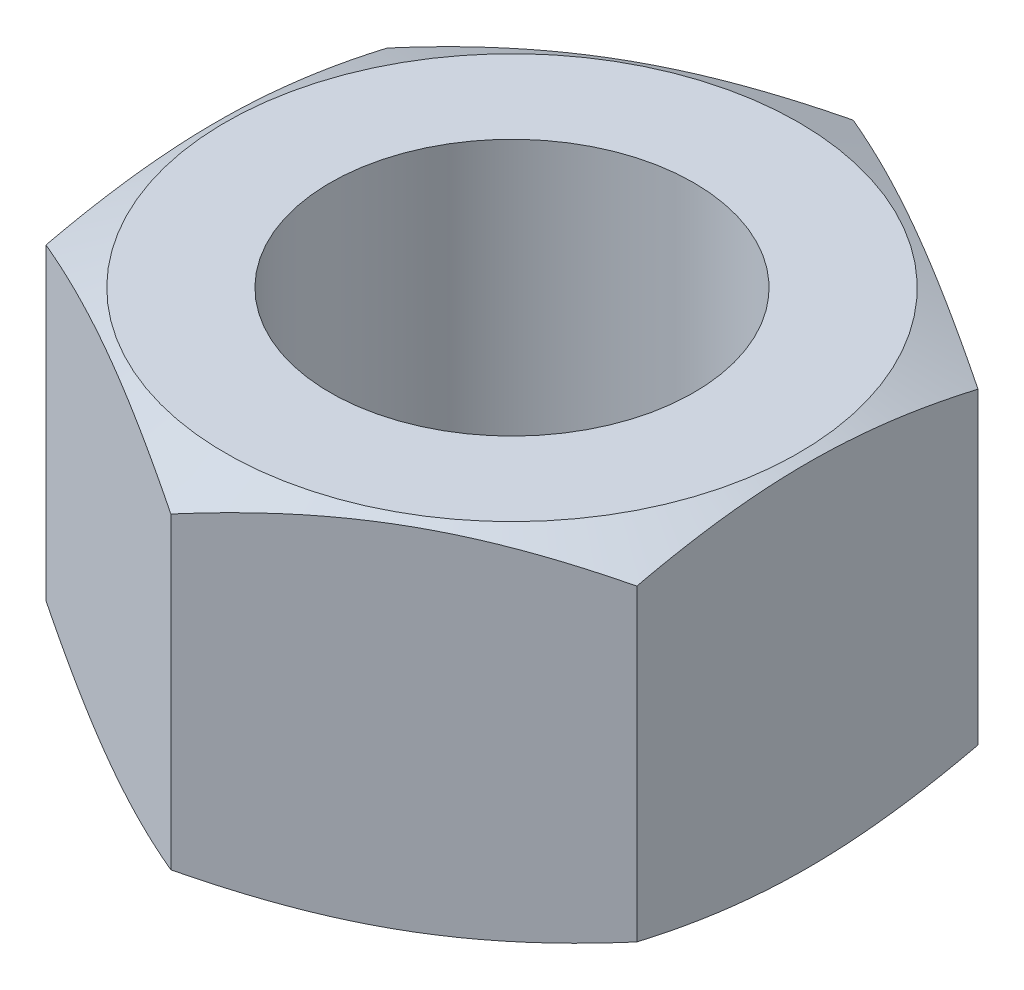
ISO-10303-21;
HEADER;
FILE_DESCRIPTION(('STEP AP214'),'2;1');
FILE_NAME('part.step','',(''),(''),'','','');
FILE_SCHEMA(('AUTOMOTIVE_DESIGN { 1 0 10303 214 1 1 1 1 }'));
ENDSEC;
DATA;
#1=APPLICATION_CONTEXT('core data for automotive mechanical design processes');
#2=APPLICATION_PROTOCOL_DEFINITION('international standard','automotive_design',2000,#1);
#3=PRODUCT_CONTEXT('',#1,'mechanical');
#4=PRODUCT('Part','Part','',(#3));
#5=PRODUCT_RELATED_PRODUCT_CATEGORY('part','',(#4));
#6=PRODUCT_DEFINITION_FORMATION('','',#4);
#7=PRODUCT_DEFINITION_CONTEXT('part definition',#1,'design');
#8=PRODUCT_DEFINITION('design','',#6,#7);
#9=PRODUCT_DEFINITION_SHAPE('','',#8);
#10=(LENGTH_UNIT() NAMED_UNIT(*) SI_UNIT(.MILLI.,.METRE.));
#11=(NAMED_UNIT(*) PLANE_ANGLE_UNIT() SI_UNIT($,.RADIAN.));
#12=(NAMED_UNIT(*) SI_UNIT($,.STERADIAN.) SOLID_ANGLE_UNIT());
#13=UNCERTAINTY_MEASURE_WITH_UNIT(LENGTH_MEASURE(1.E-05),#10,'distance_accuracy_value','');
#14=(GEOMETRIC_REPRESENTATION_CONTEXT(3) GLOBAL_UNCERTAINTY_ASSIGNED_CONTEXT((#13)) GLOBAL_UNIT_ASSIGNED_CONTEXT((#10,
#11,#12)) REPRESENTATION_CONTEXT('',''));
#15=CARTESIAN_POINT('',(0.,0.,0.));
#16=DIRECTION('',(0.,0.,1.));
#17=DIRECTION('',(1.,0.,0.));
#18=AXIS2_PLACEMENT_3D('',#15,#16,#17);
#19=CARTESIAN_POINT('',(6.30466493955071,0.,0.));
#20=DIRECTION('',(0.,-1.,0.));
#21=DIRECTION('',(0.,0.,-1.));
#22=AXIS2_PLACEMENT_3D('',#19,#20,#21);
#23=PLANE('',#22);
#24=CARTESIAN_POINT('',(0.,0.,0.));
#25=DIRECTION('',(0.,-1.,0.));
#26=DIRECTION('',(0.,0.,-1.));
#27=AXIS2_PLACEMENT_3D('',#24,#25,#26);
#28=CIRCLE('',#27,6.30466493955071);
#29=CARTESIAN_POINT('',(0.,0.,-6.30466493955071));
#30=VERTEX_POINT('',#29);
#31=EDGE_CURVE('E187',#30,#30,#28,.T.);
#32=ORIENTED_EDGE('',*,*,#31,.T.);
#33=EDGE_LOOP('',(#32));
#34=FACE_BOUND('',#33,.T.);
#35=CARTESIAN_POINT('',(0.,0.,0.));
#36=DIRECTION('',(0.,-1.,0.));
#37=DIRECTION('',(0.,0.,-1.));
#38=AXIS2_PLACEMENT_3D('',#35,#36,#37);
#39=CIRCLE('',#38,4.);
#40=CARTESIAN_POINT('',(0.,0.,-4.));
#41=VERTEX_POINT('',#40);
#42=EDGE_CURVE('E195',#41,#41,#39,.T.);
#43=ORIENTED_EDGE('',*,*,#42,.F.);
#44=EDGE_LOOP('',(#43));
#45=FACE_BOUND('',#44,.T.);
#46=ADVANCED_FACE('F29',(#34,#45),#23,.T.);
#47=CARTESIAN_POINT('',(0.,-79.,0.));
#48=DIRECTION('',(0.,-1.,0.));
#49=DIRECTION('',(0.,0.,-1.));
#50=AXIS2_PLACEMENT_3D('',#47,#48,#49);
#51=CYLINDRICAL_SURFACE('',#50,4.);
#52=ORIENTED_EDGE('',*,*,#42,.T.);
#53=EDGE_LOOP('',(#52));
#54=FACE_BOUND('',#53,.T.);
#55=CARTESIAN_POINT('',(0.,7.9,0.));
#56=DIRECTION('',(0.,-1.,0.));
#57=DIRECTION('',(0.,0.,-1.));
#58=AXIS2_PLACEMENT_3D('',#55,#56,#57);
#59=CIRCLE('',#58,4.);
#60=CARTESIAN_POINT('',(0.,7.9,-4.));
#61=VERTEX_POINT('',#60);
#62=EDGE_CURVE('E193',#61,#61,#59,.T.);
#63=ORIENTED_EDGE('',*,*,#62,.F.);
#64=EDGE_LOOP('',(#63));
#65=FACE_BOUND('',#64,.T.);
#66=ADVANCED_FACE('F225',(#54,#65),#51,.F.);
#67=CARTESIAN_POINT('',(4.,7.9,0.));
#68=DIRECTION('',(0.,1.,0.));
#69=DIRECTION('',(0.,0.,1.));
#70=AXIS2_PLACEMENT_3D('',#67,#68,#69);
#71=PLANE('',#70);
#72=ORIENTED_EDGE('',*,*,#62,.T.);
#73=EDGE_LOOP('',(#72));
#74=FACE_BOUND('',#73,.T.);
#75=CARTESIAN_POINT('',(0.,7.9,0.));
#76=DIRECTION('',(0.,-1.,0.));
#77=DIRECTION('',(0.,0.,-1.));
#78=AXIS2_PLACEMENT_3D('',#75,#76,#77);
#79=CIRCLE('',#78,6.30466493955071);
#80=CARTESIAN_POINT('',(0.,7.9,-6.30466493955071));
#81=VERTEX_POINT('',#80);
#82=EDGE_CURVE('E190',#81,#81,#79,.T.);
#83=ORIENTED_EDGE('',*,*,#82,.F.);
#84=EDGE_LOOP('',(#83));
#85=FACE_BOUND('',#84,.T.);
#86=ADVANCED_FACE('F230',(#74,#85),#71,.T.);
#87=CARTESIAN_POINT('',(0.,7.34001646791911,0.));
#88=DIRECTION('',(0.,-1.,0.));
#89=DIRECTION('',(0.,0.,-1.));
#90=AXIS2_PLACEMENT_3D('',#87,#88,#89);
#91=CONICAL_SURFACE('',#90,7.50555349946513,1.1344640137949);
#92=CARTESIAN_POINT('',(6.49999999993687,5.30274607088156,-9.93748493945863));
#93=CARTESIAN_POINT('',(6.49999999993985,5.41667076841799,-9.64546635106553));
#94=CARTESIAN_POINT('',(6.49999999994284,5.52934775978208,-9.35295178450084));
#95=CARTESIAN_POINT('',(6.49999999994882,5.75149852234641,-8.76666768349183));
#96=CARTESIAN_POINT('',(6.49999999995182,5.86097188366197,-8.4728979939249));
#97=CARTESIAN_POINT('',(6.49999999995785,6.07634363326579,-7.88291381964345));
#98=CARTESIAN_POINT('',(6.49999999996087,6.18222860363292,-7.58669441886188));
#99=CARTESIAN_POINT('',(6.49999999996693,6.38902398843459,-6.99252902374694));
#100=CARTESIAN_POINT('',(6.49999999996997,6.48993457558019,-6.69458308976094));
#101=CARTESIAN_POINT('',(6.49999999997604,6.68418723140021,-6.10062880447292));
#102=CARTESIAN_POINT('',(6.49999999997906,6.77761242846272,-5.80464777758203));
#103=CARTESIAN_POINT('',(6.49999999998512,6.95676760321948,-5.21033187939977));
#104=CARTESIAN_POINT('',(6.49999999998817,7.04249718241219,-4.91199688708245));
#105=CARTESIAN_POINT('',(6.49999999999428,7.2041444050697,-4.31297498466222));
#106=CARTESIAN_POINT('',(6.49999999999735,7.28007166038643,-4.01229068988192));
#107=CARTESIAN_POINT('',(6.50000000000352,7.41973268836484,-3.40809954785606));
#108=CARTESIAN_POINT('',(6.50000000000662,7.48346816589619,-3.10459310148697));
#109=CARTESIAN_POINT('',(6.50000000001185,7.57811857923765,-2.59147911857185));
#110=CARTESIAN_POINT('',(6.50000000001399,7.61303254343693,-2.38260947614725));
#111=CARTESIAN_POINT('',(6.50000000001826,7.67496855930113,-1.9637092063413));
#112=CARTESIAN_POINT('',(6.50000000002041,7.70199131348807,-1.75367868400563));
#113=CARTESIAN_POINT('',(6.5000000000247,7.74732791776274,-1.33276488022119));
#114=CARTESIAN_POINT('',(6.50000000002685,7.76564561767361,-1.12188201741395));
#115=CARTESIAN_POINT('',(6.50000000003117,7.79297263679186,-0.699508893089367));
#116=CARTESIAN_POINT('',(6.50000000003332,7.80198203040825,-0.48801863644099));
#117=CARTESIAN_POINT('',(6.50000000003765,7.81038398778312,-0.0639383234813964));
#118=CARTESIAN_POINT('',(6.50000000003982,7.80973519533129,0.148652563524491));
#119=CARTESIAN_POINT('',(6.50000000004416,7.7987442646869,0.573582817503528));
#120=CARTESIAN_POINT('',(6.50000000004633,7.78840199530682,0.785922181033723));
#121=CARTESIAN_POINT('',(6.50000000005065,7.75839617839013,1.20997333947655));
#122=CARTESIAN_POINT('',(6.50000000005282,7.73873101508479,1.42168501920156));
#123=CARTESIAN_POINT('',(6.50000000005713,7.69074081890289,1.84409850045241));
#124=CARTESIAN_POINT('',(6.50000000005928,7.66241605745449,2.05480033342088));
#125=CARTESIAN_POINT('',(6.50000000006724,7.5427892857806,2.83446313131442));
#126=CARTESIAN_POINT('',(6.500000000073,7.42664361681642,3.39968812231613));
#127=CARTESIAN_POINT('',(6.50000000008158,7.22276143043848,4.24011093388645));
#128=CARTESIAN_POINT('',(6.50000000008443,7.14980005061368,4.51919386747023));
#129=CARTESIAN_POINT('',(6.50000000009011,6.99585414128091,5.07514952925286));
#130=CARTESIAN_POINT('',(6.50000000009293,6.91487011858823,5.35202239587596));
#131=CARTESIAN_POINT('',(6.50000000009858,6.7459907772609,5.90530731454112));
#132=CARTESIAN_POINT('',(6.5000000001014,6.65805961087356,6.18170828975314));
#133=CARTESIAN_POINT('',(6.50000000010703,6.47695282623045,6.73278565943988));
#134=CARTESIAN_POINT('',(6.50000000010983,6.383777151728,7.00746203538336));
#135=CARTESIAN_POINT('',(6.50000000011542,6.193237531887,7.55520140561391));
#136=CARTESIAN_POINT('',(6.50000000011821,6.09587566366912,7.82826512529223));
#137=CARTESIAN_POINT('',(6.50000000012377,5.8977040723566,8.37313326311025));
#138=CARTESIAN_POINT('',(6.50000000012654,5.79689436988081,8.6449376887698));
#139=CARTESIAN_POINT('',(6.50000000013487,5.48951598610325,9.46072475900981));
#140=CARTESIAN_POINT('',(6.50000000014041,5.27869632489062,10.003104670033));
#141=CARTESIAN_POINT('',(6.50000000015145,4.84929168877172,11.0848414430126));
#142=CARTESIAN_POINT('',(6.50000000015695,4.63070568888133,11.6241978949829));
#143=CARTESIAN_POINT('',(6.50000000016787,4.19084095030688,12.6937484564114));
#144=CARTESIAN_POINT('',(6.50000000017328,3.9696324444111,13.223971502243));
#145=CARTESIAN_POINT('',(6.50000000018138,3.63487321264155,14.0179913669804));
#146=CARTESIAN_POINT('',(6.50000000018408,3.52280810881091,14.2824167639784));
#147=CARTESIAN_POINT('',(6.50000000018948,3.29781294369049,14.8108975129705));
#148=CARTESIAN_POINT('',(6.50000000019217,3.18488288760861,15.0749528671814));
#149=CARTESIAN_POINT('',(6.50000000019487,3.07158212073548,15.3388491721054));
#150=B_SPLINE_CURVE_WITH_KNOTS('',3,(#92,#93,#94,#95,#96,#97,#98,#99,#100,#101,#102,#103,#104,
#105,#106,#107,#108,#109,#110,#111,#112,#113,#114,#115,#116,#117,#118,#119,#120,#121,#122,#123,
#124,#125,#126,#127,#128,#129,#130,#131,#132,#133,#134,#135,#136,#137,#138,#139,#140,#141,#142,
#143,#144,#145,#146,#147,#148,#149),.UNSPECIFIED.,.F.,.F.,(4,2,2,2,2,2,2,2,2,2,2,2,2,2,2,2,2,2,
2,2,2,2,2,2,2,2,2,2,4),(0.,0.9403733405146,1.88086647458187,2.82455674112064,3.76821421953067,
4.69925969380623,5.63035335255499,6.56052696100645,7.4905704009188,8.12574486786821,
8.76086277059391,9.39569952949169,10.0305312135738,10.6680820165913,11.3056414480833,
11.9433114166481,12.5809614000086,14.309425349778,15.1747753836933,16.040070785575,
16.910166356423,17.7802712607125,18.6499493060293,19.5196221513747,21.2652551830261,
23.0111194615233,24.7346466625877,25.5962223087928,26.4577927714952),.UNSPECIFIED.);
#151=CARTESIAN_POINT('',(6.5,7.3400164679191,-3.75277674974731));
#152=VERTEX_POINT('',#151);
#153=CARTESIAN_POINT('',(6.50000000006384,7.34001646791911,3.752776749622));
#154=VERTEX_POINT('',#153);
#155=EDGE_CURVE('E179',#152,#154,#150,.T.);
#156=ORIENTED_EDGE('',*,*,#155,.F.);
#157=CARTESIAN_POINT('',(-0.000200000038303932,7.33996262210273,-7.50566896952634));
#158=CARTESIAN_POINT('',(0.196372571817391,7.39288440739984,-7.39217774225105));
#159=CARTESIAN_POINT('',(0.393670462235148,7.44240764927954,-7.27826775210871));
#160=CARTESIAN_POINT('',(0.789746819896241,7.53347738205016,-7.04959296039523));
#161=CARTESIAN_POINT('',(0.988526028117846,7.57501955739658,-6.93482773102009));
#162=CARTESIAN_POINT('',(1.38756958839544,7.64892241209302,-6.70443982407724));
#163=CARTESIAN_POINT('',(1.5878351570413,7.68127445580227,-6.58881644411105));
#164=CARTESIAN_POINT('',(1.9893930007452,7.73560284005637,-6.35697691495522));
#165=CARTESIAN_POINT('',(2.19068507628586,7.75758112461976,-6.24076088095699));
#166=CARTESIAN_POINT('',(2.5897806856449,7.7899478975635,-6.01034292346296));
#167=CARTESIAN_POINT('',(2.78757001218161,7.80056724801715,-5.89614920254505));
#168=CARTESIAN_POINT('',(3.18337678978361,7.81057073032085,-5.66763005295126));
#169=CARTESIAN_POINT('',(3.38139425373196,7.80995419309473,-5.55330461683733));
#170=CARTESIAN_POINT('',(3.77697589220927,7.79751697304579,-5.32491545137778));
#171=CARTESIAN_POINT('',(3.97454031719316,7.78570673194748,-5.21085157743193));
#172=CARTESIAN_POINT('',(4.36894726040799,7.7513905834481,-4.98314062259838));
#173=CARTESIAN_POINT('',(4.56578984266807,7.72888564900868,-4.86949350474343));
#174=CARTESIAN_POINT('',(4.90770983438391,7.68112741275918,-4.67208590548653));
#175=CARTESIAN_POINT('',(5.05302423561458,7.65808575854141,-4.58818859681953));
#176=CARTESIAN_POINT('',(5.34298873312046,7.60702640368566,-4.4207775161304));
#177=CARTESIAN_POINT('',(5.487638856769,7.57900891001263,-4.33726372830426));
#178=CARTESIAN_POINT('',(5.7773924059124,7.51821161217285,-4.16997443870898));
#179=CARTESIAN_POINT('',(5.92249000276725,7.48539504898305,-4.08620230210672));
#180=CARTESIAN_POINT('',(6.21191796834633,7.41564754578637,-3.91910098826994));
#181=CARTESIAN_POINT('',(6.35624846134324,7.37871729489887,-3.83577173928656));
#182=CARTESIAN_POINT('',(6.5002,7.33996262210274,-3.75266127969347));
#183=B_SPLINE_CURVE_WITH_KNOTS('',3,(#157,#158,#159,#160,#161,#162,#163,#164,#165,#166,#167,
#168,#169,#170,#171,#172,#173,#174,#175,#176,#177,#178,#179,#180,#181,#182),.UNSPECIFIED.,.F.,
.F.,(4,2,2,2,2,2,2,2,2,2,2,2,4),(0.,0.699250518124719,1.39887807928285,2.09916089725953,
2.79931243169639,3.48494652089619,4.17062143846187,4.85565737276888,5.54063099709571,
6.04866449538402,6.55667686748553,7.06880679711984,7.5808510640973),.UNSPECIFIED.);
#184=CARTESIAN_POINT('',(-3.83039315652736E-11,7.3400164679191,-7.50555349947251));
#185=VERTEX_POINT('',#184);
#186=EDGE_CURVE('E174',#185,#152,#183,.T.);
#187=ORIENTED_EDGE('',*,*,#186,.F.);
#188=CARTESIAN_POINT('',(-6.5002000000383,7.33996262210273,-3.75266127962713));
#189=CARTESIAN_POINT('',(-6.30362742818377,7.39288440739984,-3.86615250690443));
#190=CARTESIAN_POINT('',(-6.10632953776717,7.44240764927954,-3.98006249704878));
#191=CARTESIAN_POINT('',(-5.71025318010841,7.53347738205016,-4.20873728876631));
#192=CARTESIAN_POINT('',(-5.51147397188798,7.57501955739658,-4.32350251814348));
#193=CARTESIAN_POINT('',(-5.11243041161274,7.64892241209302,-4.55389042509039));
#194=CARTESIAN_POINT('',(-4.91216484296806,7.68127445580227,-4.66951380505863));
#195=CARTESIAN_POINT('',(-4.51060699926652,7.73560284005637,-4.90135333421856));
#196=CARTESIAN_POINT('',(-4.30931492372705,7.75758112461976,-5.01756936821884));
#197=CARTESIAN_POINT('',(-3.91021931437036,7.7899478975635,-5.24798732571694));
#198=CARTESIAN_POINT('',(-3.71242998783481,7.80056724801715,-5.36218104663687));
#199=CARTESIAN_POINT('',(-3.31662321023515,7.81057073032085,-5.59070019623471));
#200=CARTESIAN_POINT('',(-3.11860574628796,7.80995419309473,-5.70502563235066));
#201=CARTESIAN_POINT('',(-2.72302410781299,7.79751697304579,-5.93341479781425));
#202=CARTESIAN_POINT('',(-2.52545968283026,7.78570673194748,-6.04747867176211));
#203=CARTESIAN_POINT('',(-2.13105273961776,7.7513905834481,-6.27518962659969));
#204=CARTESIAN_POINT('',(-1.93421015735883,7.72888564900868,-6.38883674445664));
#205=CARTESIAN_POINT('',(-1.59229016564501,7.68112741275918,-6.58624434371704));
#206=CARTESIAN_POINT('',(-1.44697576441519,7.65808575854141,-6.67014165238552));
#207=CARTESIAN_POINT('',(-1.15701126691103,7.60702640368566,-6.83755273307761));
#208=CARTESIAN_POINT('',(-1.01236114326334,7.57900891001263,-6.92106652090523));
#209=CARTESIAN_POINT('',(-0.722607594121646,7.51821161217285,-7.08835581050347));
#210=CARTESIAN_POINT('',(-0.577509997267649,7.48539504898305,-7.1721279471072));
#211=CARTESIAN_POINT('',(-0.288082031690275,7.41564754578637,-7.33922926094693));
#212=CARTESIAN_POINT('',(-0.143751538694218,7.37871729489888,-7.42255850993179));
#213=CARTESIAN_POINT('',(0.000199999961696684,7.33996262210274,-7.50566896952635));
#214=B_SPLINE_CURVE_WITH_KNOTS('',3,(#188,#189,#190,#191,#192,#193,#194,#195,#196,#197,#198,
#199,#200,#201,#202,#203,#204,#205,#206,#207,#208,#209,#210,#211,#212,#213),.UNSPECIFIED.,.F.,
.F.,(4,2,2,2,2,2,2,2,2,2,2,2,4),(0.,0.69925051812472,1.39887807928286,2.09916089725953,
2.79931243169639,3.4849465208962,4.17062143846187,4.85565737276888,5.54063099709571,
6.04866449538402,6.55667686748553,7.06880679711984,7.58085106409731),.UNSPECIFIED.);
#215=CARTESIAN_POINT('',(-6.50000000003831,7.3400164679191,-3.75277674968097));
#216=VERTEX_POINT('',#215);
#217=EDGE_CURVE('E105',#216,#185,#214,.T.);
#218=ORIENTED_EDGE('',*,*,#217,.F.);
#219=CARTESIAN_POINT('',(-6.50000000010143,5.3027460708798,-9.93748493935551));
#220=CARTESIAN_POINT('',(-6.50000000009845,5.41667076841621,-9.64546635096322));
#221=CARTESIAN_POINT('',(-6.50000000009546,5.52934775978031,-9.35295178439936));
#222=CARTESIAN_POINT('',(-6.50000000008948,5.75149852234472,-8.76666768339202));
#223=CARTESIAN_POINT('',(-6.50000000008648,5.86097188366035,-8.47289799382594));
#224=CARTESIAN_POINT('',(-6.50000000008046,6.07634363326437,-7.88291381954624));
#225=CARTESIAN_POINT('',(-6.50000000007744,6.18222860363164,-7.58669441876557));
#226=CARTESIAN_POINT('',(-6.50000000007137,6.38902398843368,-6.99252902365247));
#227=CARTESIAN_POINT('',(-6.50000000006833,6.48993457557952,-6.6945830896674));
#228=CARTESIAN_POINT('',(-6.50000000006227,6.68418723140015,-6.10062880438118));
#229=CARTESIAN_POINT('',(-6.50000000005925,6.77761242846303,-5.80464777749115));
#230=CARTESIAN_POINT('',(-6.50000000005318,6.95676760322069,-5.21033187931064));
#231=CARTESIAN_POINT('',(-6.50000000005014,7.04249718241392,-4.91199688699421));
#232=CARTESIAN_POINT('',(-6.50000000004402,7.20414440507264,-4.31297498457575));
#233=CARTESIAN_POINT('',(-6.50000000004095,7.28007166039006,-4.01229068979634));
#234=CARTESIAN_POINT('',(-6.50000000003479,7.41973268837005,-3.40809954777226));
#235=CARTESIAN_POINT('',(-6.50000000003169,7.48346816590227,-3.10459310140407));
#236=CARTESIAN_POINT('',(-6.50000000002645,7.57811857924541,-2.59147911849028));
#237=CARTESIAN_POINT('',(-6.50000000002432,7.61303254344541,-2.38260947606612));
#238=CARTESIAN_POINT('',(-6.50000000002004,7.67496855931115,-1.96370920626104));
#239=CARTESIAN_POINT('',(-6.5000000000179,7.70199131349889,-1.75367868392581));
#240=CARTESIAN_POINT('',(-6.5000000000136,7.74732791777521,-1.33276488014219));
#241=CARTESIAN_POINT('',(-6.50000000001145,7.76564561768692,-1.12188201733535));
#242=CARTESIAN_POINT('',(-6.50000000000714,7.79297263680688,-0.69950889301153));
#243=CARTESIAN_POINT('',(-6.50000000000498,7.80198203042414,-0.488018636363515));
#244=CARTESIAN_POINT('',(-6.50000000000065,7.81038398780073,-0.0639383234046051));
#245=CARTESIAN_POINT('',(-6.49999999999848,7.80973519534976,0.148652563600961));
#246=CARTESIAN_POINT('',(-6.49999999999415,7.79874426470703,0.573582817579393));
#247=CARTESIAN_POINT('',(-6.49999999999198,7.78840199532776,0.785922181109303));
#248=CARTESIAN_POINT('',(-6.49999999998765,7.75839617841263,1.20997333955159));
#249=CARTESIAN_POINT('',(-6.49999999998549,7.73873101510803,1.42168501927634));
#250=CARTESIAN_POINT('',(-6.49999999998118,7.69074081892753,1.84409850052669));
#251=CARTESIAN_POINT('',(-6.49999999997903,7.66241605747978,2.05480033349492));
#252=CARTESIAN_POINT('',(-6.49999999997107,7.5427892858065,2.83446313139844));
#253=CARTESIAN_POINT('',(-6.4999999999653,7.4266436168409,3.39968812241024));
#254=CARTESIAN_POINT('',(-6.49999999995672,7.22276143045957,4.24011093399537));
#255=CARTESIAN_POINT('',(-6.49999999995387,7.14980005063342,4.51919386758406));
#256=CARTESIAN_POINT('',(-6.4999999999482,6.99585414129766,5.07514952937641));
#257=CARTESIAN_POINT('',(-6.49999999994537,6.91487011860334,5.35202239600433));
#258=CARTESIAN_POINT('',(-6.49999999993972,6.74599077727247,5.90530731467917));
#259=CARTESIAN_POINT('',(-6.4999999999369,6.65805961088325,6.18170828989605));
#260=CARTESIAN_POINT('',(-6.49999999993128,6.47695282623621,6.73278565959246));
#261=CARTESIAN_POINT('',(-6.49999999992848,6.38377715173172,7.00746203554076));
#262=CARTESIAN_POINT('',(-6.49999999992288,6.19323753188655,7.55520140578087));
#263=CARTESIAN_POINT('',(-6.4999999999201,6.09587566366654,7.82826512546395));
#264=CARTESIAN_POINT('',(-6.49999999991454,5.89770407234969,8.37313326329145));
#265=CARTESIAN_POINT('',(-6.49999999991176,5.79689436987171,8.64493768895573));
#266=CARTESIAN_POINT('',(-6.49999999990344,5.48951598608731,9.4607247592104));
#267=CARTESIAN_POINT('',(-6.4999999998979,5.27869632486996,10.0031046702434));
#268=CARTESIAN_POINT('',(-6.49999999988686,4.84929168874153,11.0848414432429));
#269=CARTESIAN_POINT('',(-6.49999999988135,4.63070568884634,11.624197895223));
#270=CARTESIAN_POINT('',(-6.49999999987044,4.19084095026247,12.6937484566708));
#271=CARTESIAN_POINT('',(-6.49999999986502,3.96963244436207,13.2239715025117));
#272=CARTESIAN_POINT('',(-6.49999999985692,3.63487321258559,14.0179913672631));
#273=CARTESIAN_POINT('',(-6.49999999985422,3.52280810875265,14.2824167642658));
#274=CARTESIAN_POINT('',(-6.49999999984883,3.29781294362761,14.8108975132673));
#275=CARTESIAN_POINT('',(-6.49999999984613,3.18488288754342,15.0749528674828));
#276=CARTESIAN_POINT('',(-6.49999999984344,3.07158212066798,15.3388491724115));
#277=B_SPLINE_CURVE_WITH_KNOTS('',3,(#219,#220,#221,#222,#223,#224,#225,#226,#227,#228,#229,
#230,#231,#232,#233,#234,#235,#236,#237,#238,#239,#240,#241,#242,#243,#244,#245,#246,#247,#248,
#249,#250,#251,#252,#253,#254,#255,#256,#257,#258,#259,#260,#261,#262,#263,#264,#265,#266,#267,
#268,#269,#270,#271,#272,#273,#274,#275,#276),.UNSPECIFIED.,.F.,.F.,(4,2,2,2,2,2,2,2,2,2,2,2,2,
2,2,2,2,2,2,2,2,2,2,2,2,2,2,2,4),(0.,0.940373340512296,1.88086647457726,2.82455674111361,
3.76821421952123,4.69925969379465,5.6303533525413,6.56052696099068,7.49057040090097,
8.12574486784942,8.76086277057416,9.39569952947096,10.0305312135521,10.6680820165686,
11.3056414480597,11.9433114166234,12.580961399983,14.3094253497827,15.1747753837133,
16.0400707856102,16.9101663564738,17.780271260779,18.6499493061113,19.5196221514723,
21.2652551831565,23.0111194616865,24.7346466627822,25.5962223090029,26.457792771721),.UNSPECIFIED.);
#278=CARTESIAN_POINT('',(-6.4999999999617,7.3400164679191,3.75277674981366));
#279=VERTEX_POINT('',#278);
#280=EDGE_CURVE('E103',#279,#216,#277,.F.);
#281=ORIENTED_EDGE('',*,*,#280,.F.);
#282=CARTESIAN_POINT('',(0.000200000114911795,7.33996262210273,7.50566896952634));
#283=CARTESIAN_POINT('',(-0.196372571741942,7.39288440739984,7.39217774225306));
#284=CARTESIAN_POINT('',(-0.393670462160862,7.44240764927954,7.27826775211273));
#285=CARTESIAN_POINT('',(-0.789746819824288,7.53347738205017,7.04959296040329));
#286=CARTESIAN_POINT('',(-0.988526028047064,7.57501955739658,6.93482773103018));
#287=CARTESIAN_POINT('',(-1.38756958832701,7.64892241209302,6.7044398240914));
#288=CARTESIAN_POINT('',(-1.58783515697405,7.68127445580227,6.58881644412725));
#289=CARTESIAN_POINT('',(-1.98939300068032,7.73560284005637,6.35697691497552));
#290=CARTESIAN_POINT('',(-2.19068507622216,7.75758112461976,6.24076088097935));
#291=CARTESIAN_POINT('',(-2.58978068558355,7.7899478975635,6.0103429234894));
#292=CARTESIAN_POINT('',(-2.78757001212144,7.80056724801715,5.8961492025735));
#293=CARTESIAN_POINT('',(-3.18337678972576,7.81057073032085,5.66763005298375));
#294=CARTESIAN_POINT('',(-3.38139425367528,7.80995419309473,5.55330461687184));
#295=CARTESIAN_POINT('',(-3.77697589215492,7.79751697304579,5.32491545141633));
#296=CARTESIAN_POINT('',(-3.97454031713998,7.78570673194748,5.2108515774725));
#297=CARTESIAN_POINT('',(-4.36894726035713,7.7513905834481,4.98314062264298));
#298=CARTESIAN_POINT('',(-4.56578984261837,7.72888564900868,4.86949350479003));
#299=CARTESIAN_POINT('',(-4.90770983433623,7.68112741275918,4.67208590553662));
#300=CARTESIAN_POINT('',(-5.05302423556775,7.65808575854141,4.58818859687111));
#301=CARTESIAN_POINT('',(-5.34298873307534,7.60702640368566,4.42077751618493));
#302=CARTESIAN_POINT('',(-5.48763885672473,7.57900891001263,4.33726372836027));
#303=CARTESIAN_POINT('',(-5.77739240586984,7.51821161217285,4.16997443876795));
#304=CARTESIAN_POINT('',(-5.92249000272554,7.48539504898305,4.08620230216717));
#305=CARTESIAN_POINT('',(-6.21191796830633,7.41564754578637,3.91910098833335));
#306=CARTESIAN_POINT('',(-6.35624846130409,7.37871729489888,3.83577173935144));
#307=CARTESIAN_POINT('',(-6.5001999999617,7.33996262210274,3.75266127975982));
#308=B_SPLINE_CURVE_WITH_KNOTS('',3,(#282,#283,#284,#285,#286,#287,#288,#289,#290,#291,#292,
#293,#294,#295,#296,#297,#298,#299,#300,#301,#302,#303,#304,#305,#306,#307),.UNSPECIFIED.,.F.,
.F.,(4,2,2,2,2,2,2,2,2,2,2,2,4),(0.,0.699250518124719,1.39887807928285,2.09916089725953,
2.79931243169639,3.48494652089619,4.17062143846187,4.85565737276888,5.54063099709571,
6.04866449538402,6.55667686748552,7.06880679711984,7.5808510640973),.UNSPECIFIED.);
#309=CARTESIAN_POINT('',(1.14911794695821E-10,7.3400164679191,7.50555349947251));
#310=VERTEX_POINT('',#309);
#311=EDGE_CURVE('E87',#310,#279,#308,.T.);
#312=ORIENTED_EDGE('',*,*,#311,.F.);
#313=CARTESIAN_POINT('',(6.50020000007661,7.33996262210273,3.75266127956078));
#314=CARTESIAN_POINT('',(6.30362742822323,7.39288440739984,3.86615250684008));
#315=CARTESIAN_POINT('',(6.1063295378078,7.44240764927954,3.98006249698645));
#316=CARTESIAN_POINT('',(5.71025318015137,7.53347738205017,4.20873728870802));
#317=CARTESIAN_POINT('',(5.51147397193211,7.57501955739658,4.32350251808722));
#318=CARTESIAN_POINT('',(5.11243041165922,7.64892241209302,4.55389042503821));
#319=CARTESIAN_POINT('',(4.91216484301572,7.68127445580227,4.66951380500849));
#320=CARTESIAN_POINT('',(4.51060699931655,7.73560284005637,4.90135333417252));
#321=CARTESIAN_POINT('',(4.30931492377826,7.75758112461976,5.01756936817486));
#322=CARTESIAN_POINT('',(3.91021931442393,7.7899478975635,5.24798732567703));
#323=CARTESIAN_POINT('',(3.71242998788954,7.80056724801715,5.36218104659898));
#324=CARTESIAN_POINT('',(3.31662321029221,7.81057073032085,5.59070019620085));
#325=CARTESIAN_POINT('',(3.1186057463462,7.80995419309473,5.70502563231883));
#326=CARTESIAN_POINT('',(2.72302410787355,7.79751697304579,5.93341479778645));
#327=CARTESIAN_POINT('',(2.52545968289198,7.78570673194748,6.04747867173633));
#328=CARTESIAN_POINT('',(2.13105273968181,7.7513905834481,6.27518962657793));
#329=CARTESIAN_POINT('',(1.93421015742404,7.72888564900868,6.3888367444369));
#330=CARTESIAN_POINT('',(1.59229016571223,7.68112741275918,6.58624434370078));
#331=CARTESIAN_POINT('',(1.44697576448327,7.65808575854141,6.67014165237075));
#332=CARTESIAN_POINT('',(1.15701126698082,7.60702640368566,6.8375527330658));
#333=CARTESIAN_POINT('',(1.01236114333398,7.57900891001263,6.9210665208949));
#334=CARTESIAN_POINT('',(0.722607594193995,7.51821161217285,7.08835581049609));
#335=CARTESIAN_POINT('',(0.577509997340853,7.48539504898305,7.17212794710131));
#336=CARTESIAN_POINT('',(0.288082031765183,7.41564754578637,7.33922926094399));
#337=CARTESIAN_POINT('',(0.143751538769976,7.37871729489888,7.42255850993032));
#338=CARTESIAN_POINT('',(-0.00019999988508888,7.33996262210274,7.50566896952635));
#339=B_SPLINE_CURVE_WITH_KNOTS('',3,(#313,#314,#315,#316,#317,#318,#319,#320,#321,#322,#323,
#324,#325,#326,#327,#328,#329,#330,#331,#332,#333,#334,#335,#336,#337,#338),.UNSPECIFIED.,.F.,
.F.,(4,2,2,2,2,2,2,2,2,2,2,2,4),(0.,0.699250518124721,1.39887807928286,2.09916089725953,
2.7993124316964,3.4849465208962,4.17062143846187,4.85565737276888,5.54063099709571,
6.04866449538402,6.55667686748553,7.06880679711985,7.58085106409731),.UNSPECIFIED.);
#340=EDGE_CURVE('E82',#154,#310,#339,.T.);
#341=ORIENTED_EDGE('',*,*,#340,.F.);
#342=EDGE_LOOP('',(#156,#187,#218,#281,#312,#341));
#343=FACE_BOUND('',#342,.T.);
#344=ORIENTED_EDGE('',*,*,#82,.T.);
#345=EDGE_LOOP('',(#344));
#346=FACE_BOUND('',#345,.T.);
#347=ADVANCED_FACE('F100',(#343,#346),#91,.T.);
#348=CARTESIAN_POINT('',(0.,0.,0.));
#349=DIRECTION('',(0.,1.,0.));
#350=DIRECTION('',(0.,0.,1.));
#351=AXIS2_PLACEMENT_3D('',#348,#349,#350);
#352=CONICAL_SURFACE('',#351,6.30466493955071,1.1344640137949);
#353=CARTESIAN_POINT('',(6.49999999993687,2.59725392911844,-9.93748493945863));
#354=CARTESIAN_POINT('',(6.49999999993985,2.48332923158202,-9.64546635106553));
#355=CARTESIAN_POINT('',(6.49999999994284,2.37065224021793,-9.35295178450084));
#356=CARTESIAN_POINT('',(6.49999999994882,2.1485014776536,-8.76666768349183));
#357=CARTESIAN_POINT('',(6.49999999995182,2.03902811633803,-8.4728979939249));
#358=CARTESIAN_POINT('',(6.49999999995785,1.82365636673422,-7.88291381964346));
#359=CARTESIAN_POINT('',(6.49999999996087,1.71777139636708,-7.58669441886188));
#360=CARTESIAN_POINT('',(6.49999999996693,1.51097601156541,-6.99252902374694));
#361=CARTESIAN_POINT('',(6.49999999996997,1.41006542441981,-6.69458308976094));
#362=CARTESIAN_POINT('',(6.49999999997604,1.21581276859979,-6.10062880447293));
#363=CARTESIAN_POINT('',(6.49999999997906,1.12238757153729,-5.80464777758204));
#364=CARTESIAN_POINT('',(6.49999999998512,0.943232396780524,-5.21033187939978));
#365=CARTESIAN_POINT('',(6.49999999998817,0.857502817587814,-4.91199688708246));
#366=CARTESIAN_POINT('',(6.49999999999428,0.695855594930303,-4.31297498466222));
#367=CARTESIAN_POINT('',(6.49999999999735,0.619928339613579,-4.01229068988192));
#368=CARTESIAN_POINT('',(6.50000000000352,0.480267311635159,-3.40809954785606));
#369=CARTESIAN_POINT('',(6.50000000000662,0.416531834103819,-3.10459310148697));
#370=CARTESIAN_POINT('',(6.50000000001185,0.321881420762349,-2.59147911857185));
#371=CARTESIAN_POINT('',(6.50000000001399,0.286967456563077,-2.38260947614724));
#372=CARTESIAN_POINT('',(6.50000000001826,0.225031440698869,-1.96370920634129));
#373=CARTESIAN_POINT('',(6.50000000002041,0.198008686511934,-1.75367868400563));
#374=CARTESIAN_POINT('',(6.5000000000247,0.152672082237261,-1.33276488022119));
#375=CARTESIAN_POINT('',(6.50000000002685,0.134354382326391,-1.12188201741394));
#376=CARTESIAN_POINT('',(6.50000000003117,0.107027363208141,-0.699508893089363));
#377=CARTESIAN_POINT('',(6.50000000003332,0.0980179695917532,-0.488018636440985));
#378=CARTESIAN_POINT('',(6.50000000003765,0.0896160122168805,-0.0639383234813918));
#379=CARTESIAN_POINT('',(6.50000000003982,0.0902648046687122,0.148652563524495));
#380=CARTESIAN_POINT('',(6.50000000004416,0.101255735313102,0.573582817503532));
#381=CARTESIAN_POINT('',(6.50000000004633,0.111598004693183,0.785922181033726));
#382=CARTESIAN_POINT('',(6.50000000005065,0.141603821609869,1.20997333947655));
#383=CARTESIAN_POINT('',(6.50000000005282,0.161268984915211,1.42168501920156));
#384=CARTESIAN_POINT('',(6.50000000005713,0.20925918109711,1.84409850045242));
#385=CARTESIAN_POINT('',(6.50000000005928,0.237583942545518,2.05480033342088));
#386=CARTESIAN_POINT('',(6.50000000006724,0.357210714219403,2.83446313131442));
#387=CARTESIAN_POINT('',(6.500000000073,0.473356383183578,3.39968812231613));
#388=CARTESIAN_POINT('',(6.50000000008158,0.677238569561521,4.24011093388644));
#389=CARTESIAN_POINT('',(6.50000000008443,0.750199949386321,4.51919386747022));
#390=CARTESIAN_POINT('',(6.50000000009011,0.904145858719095,5.07514952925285));
#391=CARTESIAN_POINT('',(6.50000000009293,0.985129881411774,5.35202239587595));
#392=CARTESIAN_POINT('',(6.50000000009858,1.15400922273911,5.9053073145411));
#393=CARTESIAN_POINT('',(6.5000000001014,1.24194038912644,6.18170828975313));
#394=CARTESIAN_POINT('',(6.50000000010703,1.42304717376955,6.73278565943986));
#395=CARTESIAN_POINT('',(6.50000000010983,1.516222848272,7.00746203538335));
#396=CARTESIAN_POINT('',(6.50000000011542,1.706762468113,7.5552014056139));
#397=CARTESIAN_POINT('',(6.50000000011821,1.80412433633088,7.82826512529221));
#398=CARTESIAN_POINT('',(6.50000000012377,2.0022959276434,8.37313326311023));
#399=CARTESIAN_POINT('',(6.50000000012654,2.10310563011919,8.64493768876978));
#400=CARTESIAN_POINT('',(6.50000000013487,2.41048401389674,9.4607247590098));
#401=CARTESIAN_POINT('',(6.50000000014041,2.62130367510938,10.0031046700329));
#402=CARTESIAN_POINT('',(6.50000000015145,3.05070831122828,11.0848414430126));
#403=CARTESIAN_POINT('',(6.50000000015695,3.26929431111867,11.6241978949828));
#404=CARTESIAN_POINT('',(6.50000000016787,3.70915904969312,12.6937484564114));
#405=CARTESIAN_POINT('',(6.50000000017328,3.9303675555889,13.223971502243));
#406=CARTESIAN_POINT('',(6.50000000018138,4.26512678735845,14.0179913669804));
#407=CARTESIAN_POINT('',(6.50000000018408,4.37719189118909,14.2824167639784));
#408=CARTESIAN_POINT('',(6.50000000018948,4.60218705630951,14.8108975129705));
#409=CARTESIAN_POINT('',(6.50000000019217,4.71511711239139,15.0749528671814));
#410=CARTESIAN_POINT('',(6.50000000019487,4.82841787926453,15.3388491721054));
#411=B_SPLINE_CURVE_WITH_KNOTS('',3,(#353,#354,#355,#356,#357,#358,#359,#360,#361,#362,#363,
#364,#365,#366,#367,#368,#369,#370,#371,#372,#373,#374,#375,#376,#377,#378,#379,#380,#381,#382,
#383,#384,#385,#386,#387,#388,#389,#390,#391,#392,#393,#394,#395,#396,#397,#398,#399,#400,#401,
#402,#403,#404,#405,#406,#407,#408,#409,#410),.UNSPECIFIED.,.F.,.F.,(4,2,2,2,2,2,2,2,2,2,2,2,2,
2,2,2,2,2,2,2,2,2,2,2,2,2,2,2,4),(0.,0.940373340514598,1.88086647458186,2.82455674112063,
3.76821421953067,4.69925969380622,5.63035335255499,6.56052696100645,7.4905704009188,
8.12574486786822,8.76086277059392,9.39569952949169,10.0305312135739,10.6680820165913,
11.3056414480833,11.9433114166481,12.5809614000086,14.309425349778,15.1747753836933,
16.040070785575,16.910166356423,17.7802712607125,18.6499493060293,19.5196221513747,
21.2652551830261,23.0111194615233,24.7346466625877,25.5962223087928,26.4577927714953),.UNSPECIFIED.);
#412=CARTESIAN_POINT('',(6.50000000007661,0.559983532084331,3.75277674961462));
#413=VERTEX_POINT('',#412);
#414=CARTESIAN_POINT('',(6.5,0.559983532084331,-3.75277674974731));
#415=VERTEX_POINT('',#414);
#416=EDGE_CURVE('E11',#413,#415,#411,.F.);
#417=ORIENTED_EDGE('',*,*,#416,.F.);
#418=CARTESIAN_POINT('',(-0.000199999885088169,0.560037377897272,7.50566896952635));
#419=CARTESIAN_POINT('',(0.19637257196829,0.507115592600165,7.39217774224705));
#420=CARTESIAN_POINT('',(0.393670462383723,0.457592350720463,7.27826775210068));
#421=CARTESIAN_POINT('',(0.789746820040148,0.366522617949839,7.04959296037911));
#422=CARTESIAN_POINT('',(0.98852602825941,0.324980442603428,6.93482773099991));
#423=CARTESIAN_POINT('',(1.3875695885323,0.251077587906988,6.70443982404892));
#424=CARTESIAN_POINT('',(1.5878351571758,0.21872554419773,6.58881644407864));
#425=CARTESIAN_POINT('',(1.98939300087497,0.164397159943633,6.35697691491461));
#426=CARTESIAN_POINT('',(2.19068507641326,0.14241887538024,6.24076088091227));
#427=CARTESIAN_POINT('',(2.58978068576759,0.110052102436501,6.0103429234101));
#428=CARTESIAN_POINT('',(2.78757001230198,0.0994327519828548,5.89614920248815));
#429=CARTESIAN_POINT('',(3.18337678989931,0.0894292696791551,5.66763005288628));
#430=CARTESIAN_POINT('',(3.38139425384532,0.0900458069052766,5.5533046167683));
#431=CARTESIAN_POINT('',(3.77697589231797,0.102483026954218,5.32491545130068));
#432=CARTESIAN_POINT('',(3.97454031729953,0.114293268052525,5.2108515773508));
#433=CARTESIAN_POINT('',(4.36894726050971,0.148609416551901,4.9831406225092));
#434=CARTESIAN_POINT('',(4.56578984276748,0.171114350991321,4.86949350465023));
#435=CARTESIAN_POINT('',(4.90770983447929,0.218872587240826,4.67208590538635));
#436=CARTESIAN_POINT('',(5.05302423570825,0.241914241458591,4.58818859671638));
#437=CARTESIAN_POINT('',(5.3429887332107,0.292973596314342,4.42077751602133));
#438=CARTESIAN_POINT('',(5.48763885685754,0.320991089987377,4.33726372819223));
#439=CARTESIAN_POINT('',(5.77739240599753,0.381788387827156,4.16997443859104));
#440=CARTESIAN_POINT('',(5.92249000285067,0.414604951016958,4.08620230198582));
#441=CARTESIAN_POINT('',(6.21191796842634,0.484352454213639,3.91910098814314));
#442=CARTESIAN_POINT('',(6.35624846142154,0.52128270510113,3.83577173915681));
#443=CARTESIAN_POINT('',(6.50020000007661,0.560037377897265,3.75266127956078));
#444=B_SPLINE_CURVE_WITH_KNOTS('',3,(#418,#419,#420,#421,#422,#423,#424,#425,#426,#427,#428,
#429,#430,#431,#432,#433,#434,#435,#436,#437,#438,#439,#440,#441,#442,#443),.UNSPECIFIED.,.F.,
.F.,(4,2,2,2,2,2,2,2,2,2,2,2,4),(0.,0.69925051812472,1.39887807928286,2.09916089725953,
2.7993124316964,3.4849465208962,4.17062143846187,4.85565737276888,5.54063099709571,
6.04866449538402,6.55667686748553,7.06880679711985,7.58085106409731),.UNSPECIFIED.);
#445=CARTESIAN_POINT('',(1.27680852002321E-10,0.559983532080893,7.50555349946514));
#446=VERTEX_POINT('',#445);
#447=EDGE_CURVE('E138',#446,#413,#444,.T.);
#448=ORIENTED_EDGE('',*,*,#447,.F.);
#449=CARTESIAN_POINT('',(-6.5001999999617,0.560037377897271,3.75266127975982));
#450=CARTESIAN_POINT('',(-6.30362742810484,0.507115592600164,3.8661525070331));
#451=CARTESIAN_POINT('',(-6.10632953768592,0.457592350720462,3.98006249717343));
#452=CARTESIAN_POINT('',(-5.7102531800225,0.366522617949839,4.20873728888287));
#453=CARTESIAN_POINT('',(-5.51147397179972,0.324980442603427,4.32350251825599));
#454=CARTESIAN_POINT('',(-5.11243041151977,0.251077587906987,4.55389042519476));
#455=CARTESIAN_POINT('',(-4.91216484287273,0.21872554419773,4.66951380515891));
#456=CARTESIAN_POINT('',(-4.51060699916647,0.164397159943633,4.90135333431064));
#457=CARTESIAN_POINT('',(-4.30931492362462,0.142418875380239,5.01756936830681));
#458=CARTESIAN_POINT('',(-3.91021931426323,0.1100521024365,5.24798732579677));
#459=CARTESIAN_POINT('',(-3.71242998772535,0.0994327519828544,5.36218104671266));
#460=CARTESIAN_POINT('',(-3.31662321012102,0.0894292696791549,5.59070019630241));
#461=CARTESIAN_POINT('',(-3.1186057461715,0.0900458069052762,5.70502563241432));
#462=CARTESIAN_POINT('',(-2.72302410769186,0.102483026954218,5.93341479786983));
#463=CARTESIAN_POINT('',(-2.52545968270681,0.114293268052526,6.04747867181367));
#464=CARTESIAN_POINT('',(-2.13105273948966,0.148609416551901,6.27518962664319));
#465=CARTESIAN_POINT('',(-1.93421015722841,0.171114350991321,6.38883674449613));
#466=CARTESIAN_POINT('',(-1.59229016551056,0.218872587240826,6.58624434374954));
#467=CARTESIAN_POINT('',(-1.44697576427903,0.241914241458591,6.67014165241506));
#468=CARTESIAN_POINT('',(-1.15701126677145,0.292973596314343,6.83755273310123));
#469=CARTESIAN_POINT('',(-1.01236114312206,0.320991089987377,6.9210665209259));
#470=CARTESIAN_POINT('',(-0.722607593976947,0.381788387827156,7.08835581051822));
#471=CARTESIAN_POINT('',(-0.57750999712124,0.414604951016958,7.17212794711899));
#472=CARTESIAN_POINT('',(-0.288082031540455,0.484352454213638,7.33922926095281));
#473=CARTESIAN_POINT('',(-0.143751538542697,0.521282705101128,7.42255850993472));
#474=CARTESIAN_POINT('',(0.000200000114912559,0.560037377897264,7.50566896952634));
#475=B_SPLINE_CURVE_WITH_KNOTS('',3,(#449,#450,#451,#452,#453,#454,#455,#456,#457,#458,#459,
#460,#461,#462,#463,#464,#465,#466,#467,#468,#469,#470,#471,#472,#473,#474),.UNSPECIFIED.,.F.,
.F.,(4,2,2,2,2,2,2,2,2,2,2,2,4),(0.,0.699250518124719,1.39887807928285,2.09916089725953,
2.79931243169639,3.4849465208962,4.17062143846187,4.85565737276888,5.54063099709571,
6.04866449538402,6.55667686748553,7.06880679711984,7.5808510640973),.UNSPECIFIED.);
#476=CARTESIAN_POINT('',(-6.4999999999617,0.55998353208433,3.75277674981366));
#477=VERTEX_POINT('',#476);
#478=EDGE_CURVE('E95',#477,#446,#475,.T.);
#479=ORIENTED_EDGE('',*,*,#478,.F.);
#480=CARTESIAN_POINT('',(-6.50000000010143,2.5972539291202,-9.9374849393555));
#481=CARTESIAN_POINT('',(-6.50000000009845,2.48332923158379,-9.64546635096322));
#482=CARTESIAN_POINT('',(-6.50000000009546,2.37065224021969,-9.35295178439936));
#483=CARTESIAN_POINT('',(-6.50000000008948,2.14850147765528,-8.76666768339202));
#484=CARTESIAN_POINT('',(-6.50000000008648,2.03902811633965,-8.47289799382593));
#485=CARTESIAN_POINT('',(-6.50000000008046,1.82365636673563,-7.88291381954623));
#486=CARTESIAN_POINT('',(-6.50000000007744,1.71777139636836,-7.58669441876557));
#487=CARTESIAN_POINT('',(-6.50000000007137,1.51097601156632,-6.99252902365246));
#488=CARTESIAN_POINT('',(-6.50000000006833,1.41006542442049,-6.69458308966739));
#489=CARTESIAN_POINT('',(-6.50000000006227,1.21581276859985,-6.10062880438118));
#490=CARTESIAN_POINT('',(-6.50000000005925,1.12238757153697,-5.80464777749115));
#491=CARTESIAN_POINT('',(-6.50000000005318,0.943232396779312,-5.21033187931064));
#492=CARTESIAN_POINT('',(-6.50000000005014,0.857502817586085,-4.9119968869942));
#493=CARTESIAN_POINT('',(-6.50000000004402,0.695855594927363,-4.31297498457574));
#494=CARTESIAN_POINT('',(-6.50000000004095,0.619928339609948,-4.01229068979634));
#495=CARTESIAN_POINT('',(-6.50000000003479,0.480267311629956,-3.40809954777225));
#496=CARTESIAN_POINT('',(-6.50000000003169,0.416531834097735,-3.10459310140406));
#497=CARTESIAN_POINT('',(-6.50000000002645,0.321881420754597,-2.59147911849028));
#498=CARTESIAN_POINT('',(-6.50000000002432,0.286967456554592,-2.38260947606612));
#499=CARTESIAN_POINT('',(-6.50000000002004,0.225031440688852,-1.96370920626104));
#500=CARTESIAN_POINT('',(-6.5000000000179,0.198008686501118,-1.75367868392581));
#501=CARTESIAN_POINT('',(-6.5000000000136,0.152672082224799,-1.33276488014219));
#502=CARTESIAN_POINT('',(-6.50000000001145,0.134354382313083,-1.12188201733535));
#503=CARTESIAN_POINT('',(-6.50000000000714,0.107027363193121,-0.699508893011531));
#504=CARTESIAN_POINT('',(-6.50000000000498,0.0980179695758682,-0.488018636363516));
#505=CARTESIAN_POINT('',(-6.50000000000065,0.0896160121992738,-0.063938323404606));
#506=CARTESIAN_POINT('',(-6.49999999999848,0.0902648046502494,0.14865256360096));
#507=CARTESIAN_POINT('',(-6.49999999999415,0.101255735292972,0.573582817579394));
#508=CARTESIAN_POINT('',(-6.49999999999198,0.111598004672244,0.785922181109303));
#509=CARTESIAN_POINT('',(-6.49999999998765,0.141603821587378,1.20997333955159));
#510=CARTESIAN_POINT('',(-6.49999999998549,0.161268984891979,1.42168501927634));
#511=CARTESIAN_POINT('',(-6.49999999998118,0.209259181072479,1.84409850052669));
#512=CARTESIAN_POINT('',(-6.49999999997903,0.237583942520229,2.05480033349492));
#513=CARTESIAN_POINT('',(-6.49999999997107,0.357210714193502,2.83446313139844));
#514=CARTESIAN_POINT('',(-6.4999999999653,0.473356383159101,3.39968812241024));
#515=CARTESIAN_POINT('',(-6.49999999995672,0.677238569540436,4.24011093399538));
#516=CARTESIAN_POINT('',(-6.49999999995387,0.750199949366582,4.51919386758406));
#517=CARTESIAN_POINT('',(-6.4999999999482,0.904145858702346,5.07514952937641));
#518=CARTESIAN_POINT('',(-6.49999999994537,0.985129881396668,5.35202239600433));
#519=CARTESIAN_POINT('',(-6.49999999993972,1.15400922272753,5.90530731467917));
#520=CARTESIAN_POINT('',(-6.4999999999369,1.24194038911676,6.18170828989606));
#521=CARTESIAN_POINT('',(-6.49999999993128,1.4230471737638,6.73278565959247));
#522=CARTESIAN_POINT('',(-6.49999999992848,1.51622284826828,7.00746203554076));
#523=CARTESIAN_POINT('',(-6.49999999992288,1.70676246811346,7.55520140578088));
#524=CARTESIAN_POINT('',(-6.4999999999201,1.80412433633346,7.82826512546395));
#525=CARTESIAN_POINT('',(-6.49999999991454,2.00229592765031,8.37313326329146));
#526=CARTESIAN_POINT('',(-6.49999999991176,2.1031056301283,8.64493768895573));
#527=CARTESIAN_POINT('',(-6.49999999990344,2.4104840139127,9.46072475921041));
#528=CARTESIAN_POINT('',(-6.4999999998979,2.62130367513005,10.0031046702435));
#529=CARTESIAN_POINT('',(-6.49999999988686,3.05070831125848,11.0848414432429));
#530=CARTESIAN_POINT('',(-6.49999999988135,3.26929431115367,11.624197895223));
#531=CARTESIAN_POINT('',(-6.49999999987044,3.70915904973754,12.6937484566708));
#532=CARTESIAN_POINT('',(-6.49999999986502,3.93036755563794,13.2239715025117));
#533=CARTESIAN_POINT('',(-6.49999999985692,4.26512678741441,14.0179913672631));
#534=CARTESIAN_POINT('',(-6.49999999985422,4.37719189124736,14.2824167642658));
#535=CARTESIAN_POINT('',(-6.49999999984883,4.6021870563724,14.8108975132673));
#536=CARTESIAN_POINT('',(-6.49999999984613,4.71511711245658,15.0749528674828));
#537=CARTESIAN_POINT('',(-6.49999999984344,4.82841787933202,15.3388491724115));
#538=B_SPLINE_CURVE_WITH_KNOTS('',3,(#480,#481,#482,#483,#484,#485,#486,#487,#488,#489,#490,
#491,#492,#493,#494,#495,#496,#497,#498,#499,#500,#501,#502,#503,#504,#505,#506,#507,#508,#509,
#510,#511,#512,#513,#514,#515,#516,#517,#518,#519,#520,#521,#522,#523,#524,#525,#526,#527,#528,
#529,#530,#531,#532,#533,#534,#535,#536,#537),.UNSPECIFIED.,.F.,.F.,(4,2,2,2,2,2,2,2,2,2,2,2,2,
2,2,2,2,2,2,2,2,2,2,2,2,2,2,2,4),(0.,0.9403733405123,1.88086647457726,2.82455674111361,
3.76821421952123,4.69925969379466,5.6303533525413,6.56052696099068,7.49057040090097,
8.12574486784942,8.76086277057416,9.39569952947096,10.0305312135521,10.6680820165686,
11.3056414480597,11.9433114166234,12.580961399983,14.3094253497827,15.1747753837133,
16.0400707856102,16.9101663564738,17.780271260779,18.6499493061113,19.5196221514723,
21.2652551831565,23.0111194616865,24.7346466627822,25.5962223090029,26.457792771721),.UNSPECIFIED.);
#539=CARTESIAN_POINT('',(-6.50000000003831,0.559983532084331,-3.75277674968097));
#540=VERTEX_POINT('',#539);
#541=EDGE_CURVE('E137',#540,#477,#538,.T.);
#542=ORIENTED_EDGE('',*,*,#541,.F.);
#543=CARTESIAN_POINT('',(0.000199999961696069,0.560037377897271,-7.50566896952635));
#544=CARTESIAN_POINT('',(-0.196372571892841,0.507115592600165,-7.39217774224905));
#545=CARTESIAN_POINT('',(-0.393670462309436,0.457592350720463,-7.27826775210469));
#546=CARTESIAN_POINT('',(-0.789746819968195,0.366522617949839,-7.04959296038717));
#547=CARTESIAN_POINT('',(-0.988526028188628,0.324980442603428,-6.93482773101));
#548=CARTESIAN_POINT('',(-1.38756958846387,0.251077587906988,-6.70443982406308));
#549=CARTESIAN_POINT('',(-1.58783515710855,0.218725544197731,-6.58881644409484));
#550=CARTESIAN_POINT('',(-1.98939300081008,0.164397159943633,-6.35697691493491));
#551=CARTESIAN_POINT('',(-2.19068507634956,0.14241887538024,-6.24076088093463));
#552=CARTESIAN_POINT('',(-2.58978068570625,0.1100521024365,-6.01034292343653));
#553=CARTESIAN_POINT('',(-2.7875700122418,0.0994327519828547,-5.8961492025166));
#554=CARTESIAN_POINT('',(-3.18337678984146,0.0894292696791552,-5.66763005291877));
#555=CARTESIAN_POINT('',(-3.38139425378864,0.0900458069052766,-5.55330461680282));
#556=CARTESIAN_POINT('',(-3.77697589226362,0.102483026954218,-5.32491545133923));
#557=CARTESIAN_POINT('',(-3.97454031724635,0.114293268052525,-5.21085157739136));
#558=CARTESIAN_POINT('',(-4.36894726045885,0.148609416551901,-4.98314062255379));
#559=CARTESIAN_POINT('',(-4.56578984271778,0.171114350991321,-4.86949350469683));
#560=CARTESIAN_POINT('',(-4.9077098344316,0.218872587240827,-4.67208590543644));
#561=CARTESIAN_POINT('',(-5.05302423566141,0.241914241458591,-4.58818859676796));
#562=CARTESIAN_POINT('',(-5.34298873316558,0.292973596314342,-4.42077751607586));
#563=CARTESIAN_POINT('',(-5.48763885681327,0.320991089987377,-4.33726372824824));
#564=CARTESIAN_POINT('',(-5.77739240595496,0.381788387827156,-4.16997443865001));
#565=CARTESIAN_POINT('',(-5.92249000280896,0.414604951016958,-4.08620230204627));
#566=CARTESIAN_POINT('',(-6.21191796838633,0.484352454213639,-3.91910098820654));
#567=CARTESIAN_POINT('',(-6.35624846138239,0.52128270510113,-3.83577173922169));
#568=CARTESIAN_POINT('',(-6.50020000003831,0.560037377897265,-3.75266127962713));
#569=B_SPLINE_CURVE_WITH_KNOTS('',3,(#543,#544,#545,#546,#547,#548,#549,#550,#551,#552,#553,
#554,#555,#556,#557,#558,#559,#560,#561,#562,#563,#564,#565,#566,#567,#568),.UNSPECIFIED.,.F.,
.F.,(4,2,2,2,2,2,2,2,2,2,2,2,4),(0.,0.69925051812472,1.39887807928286,2.09916089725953,
2.7993124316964,3.4849465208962,4.17062143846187,4.85565737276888,5.54063099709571,
6.04866449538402,6.55667686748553,7.06880679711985,7.58085106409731),.UNSPECIFIED.);
#570=CARTESIAN_POINT('',(-3.83039315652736E-11,0.55998353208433,-7.50555349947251));
#571=VERTEX_POINT('',#570);
#572=EDGE_CURVE('E159',#571,#540,#569,.T.);
#573=ORIENTED_EDGE('',*,*,#572,.F.);
#574=CARTESIAN_POINT('',(6.5002,0.560037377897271,-3.75266127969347));
#575=CARTESIAN_POINT('',(6.30362742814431,0.507115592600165,-3.86615250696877));
#576=CARTESIAN_POINT('',(6.10632953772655,0.457592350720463,-3.98006249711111));
#577=CARTESIAN_POINT('',(5.71025318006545,0.366522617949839,-4.20873728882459));
#578=CARTESIAN_POINT('',(5.51147397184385,0.324980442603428,-4.32350251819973));
#579=CARTESIAN_POINT('',(5.11243041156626,0.251077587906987,-4.55389042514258));
#580=CARTESIAN_POINT('',(4.91216484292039,0.21872554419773,-4.66951380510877));
#581=CARTESIAN_POINT('',(4.5106069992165,0.164397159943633,-4.9013533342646));
#582=CARTESIAN_POINT('',(4.30931492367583,0.14241887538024,-5.01756936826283));
#583=CARTESIAN_POINT('',(3.9102193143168,0.1100521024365,-5.24798732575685));
#584=CARTESIAN_POINT('',(3.71242998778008,0.0994327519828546,-5.36218104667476));
#585=CARTESIAN_POINT('',(3.31662321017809,0.0894292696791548,-5.59070019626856));
#586=CARTESIAN_POINT('',(3.11860574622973,0.0900458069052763,-5.70502563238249));
#587=CARTESIAN_POINT('',(2.72302410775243,0.102483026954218,-5.93341479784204));
#588=CARTESIAN_POINT('',(2.52545968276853,0.114293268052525,-6.04747867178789));
#589=CARTESIAN_POINT('',(2.13105273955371,0.148609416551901,-6.27518962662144));
#590=CARTESIAN_POINT('',(1.93421015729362,0.171114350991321,-6.38883674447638));
#591=CARTESIAN_POINT('',(1.59229016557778,0.218872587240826,-6.58624434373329));
#592=CARTESIAN_POINT('',(1.44697576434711,0.241914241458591,-6.67014165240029));
#593=CARTESIAN_POINT('',(1.15701126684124,0.292973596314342,-6.83755273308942));
#594=CARTESIAN_POINT('',(1.0123611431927,0.320991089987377,-6.92106652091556));
#595=CARTESIAN_POINT('',(0.722607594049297,0.381788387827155,-7.08835581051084));
#596=CARTESIAN_POINT('',(0.577509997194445,0.414604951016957,-7.1721279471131));
#597=CARTESIAN_POINT('',(0.288082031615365,0.484352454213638,-7.33922926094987));
#598=CARTESIAN_POINT('',(0.143751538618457,0.521282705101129,-7.42255850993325));
#599=CARTESIAN_POINT('',(-0.000200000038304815,0.560037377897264,-7.50566896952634));
#600=B_SPLINE_CURVE_WITH_KNOTS('',3,(#574,#575,#576,#577,#578,#579,#580,#581,#582,#583,#584,
#585,#586,#587,#588,#589,#590,#591,#592,#593,#594,#595,#596,#597,#598,#599),.UNSPECIFIED.,.F.,
.F.,(4,2,2,2,2,2,2,2,2,2,2,2,4),(0.,0.69925051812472,1.39887807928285,2.09916089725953,
2.7993124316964,3.4849465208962,4.17062143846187,4.85565737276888,5.54063099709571,
6.04866449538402,6.55667686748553,7.06880679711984,7.58085106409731),.UNSPECIFIED.);
#601=EDGE_CURVE('E41',#415,#571,#600,.T.);
#602=ORIENTED_EDGE('',*,*,#601,.F.);
#603=EDGE_LOOP('',(#417,#448,#479,#542,#573,#602));
#604=FACE_BOUND('',#603,.T.);
#605=ORIENTED_EDGE('',*,*,#31,.F.);
#606=EDGE_LOOP('',(#605));
#607=FACE_BOUND('',#606,.T.);
#608=ADVANCED_FACE('F147',(#604,#607),#352,.T.);
#609=CARTESIAN_POINT('',(6.50000000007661,7.9,3.75277674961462));
#610=DIRECTION('',(-1.,0.,1.0206840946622E-11));
#611=DIRECTION('',(1.0206840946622E-11,0.,1.));
#612=AXIS2_PLACEMENT_3D('',#609,#610,#611);
#613=PLANE('',#612);
#614=ORIENTED_EDGE('',*,*,#155,.T.);
#615=DIRECTION('',(0.,-1.,0.));
#616=VECTOR('',#615,1.);
#617=CARTESIAN_POINT('',(6.50000000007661,7.9,3.75277674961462));
#618=LINE('',#617,#616);
#619=EDGE_CURVE('E48',#154,#413,#618,.T.);
#620=ORIENTED_EDGE('',*,*,#619,.T.);
#621=ORIENTED_EDGE('',*,*,#416,.T.);
#622=DIRECTION('',(0.,-1.,0.));
#623=VECTOR('',#622,1.);
#624=CARTESIAN_POINT('',(6.5,7.9,-3.75277674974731));
#625=LINE('',#624,#623);
#626=EDGE_CURVE('E88',#152,#415,#625,.T.);
#627=ORIENTED_EDGE('',*,*,#626,.F.);
#628=EDGE_LOOP('',(#614,#620,#621,#627));
#629=FACE_BOUND('',#628,.T.);
#630=ADVANCED_FACE('F150',(#629),#613,.F.);
#631=CARTESIAN_POINT('',(6.5,7.9,-3.75277674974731));
#632=DIRECTION('',(-0.499999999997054,0.,0.86602540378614));
#633=DIRECTION('',(0.86602540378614,0.,0.499999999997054));
#634=AXIS2_PLACEMENT_3D('',#631,#632,#633);
#635=PLANE('',#634);
#636=ORIENTED_EDGE('',*,*,#186,.T.);
#637=ORIENTED_EDGE('',*,*,#626,.T.);
#638=ORIENTED_EDGE('',*,*,#601,.T.);
#639=DIRECTION('',(0.,-1.,0.));
#640=VECTOR('',#639,1.);
#641=CARTESIAN_POINT('',(-3.83039315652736E-11,7.9,-7.50555349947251));
#642=LINE('',#641,#640);
#643=EDGE_CURVE('E210',#185,#571,#642,.T.);
#644=ORIENTED_EDGE('',*,*,#643,.F.);
#645=EDGE_LOOP('',(#636,#637,#638,#644));
#646=FACE_BOUND('',#645,.T.);
#647=ADVANCED_FACE('F166',(#646),#635,.F.);
#648=CARTESIAN_POINT('',(-3.83039315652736E-11,7.9,-7.50555349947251));
#649=DIRECTION('',(0.500000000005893,0.,0.866025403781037));
#650=DIRECTION('',(0.866025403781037,0.,-0.500000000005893));
#651=AXIS2_PLACEMENT_3D('',#648,#649,#650);
#652=PLANE('',#651);
#653=ORIENTED_EDGE('',*,*,#217,.T.);
#654=ORIENTED_EDGE('',*,*,#643,.T.);
#655=ORIENTED_EDGE('',*,*,#572,.T.);
#656=DIRECTION('',(0.,-1.,0.));
#657=VECTOR('',#656,1.);
#658=CARTESIAN_POINT('',(-6.50000000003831,7.9,-3.75277674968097));
#659=LINE('',#658,#657);
#660=EDGE_CURVE('E215',#216,#540,#659,.T.);
#661=ORIENTED_EDGE('',*,*,#660,.F.);
#662=EDGE_LOOP('',(#653,#654,#655,#661));
#663=FACE_BOUND('',#662,.T.);
#664=ADVANCED_FACE('F169',(#663),#652,.F.);
#665=CARTESIAN_POINT('',(-6.50000000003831,7.9,-3.75277674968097));
#666=DIRECTION('',(1.,0.,-1.0206956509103E-11));
#667=DIRECTION('',(-1.0206956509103E-11,0.,-1.));
#668=AXIS2_PLACEMENT_3D('',#665,#666,#667);
#669=PLANE('',#668);
#670=ORIENTED_EDGE('',*,*,#280,.T.);
#671=ORIENTED_EDGE('',*,*,#660,.T.);
#672=ORIENTED_EDGE('',*,*,#541,.T.);
#673=DIRECTION('',(0.,-1.,0.));
#674=VECTOR('',#673,1.);
#675=CARTESIAN_POINT('',(-6.4999999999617,7.9,3.75277674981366));
#676=LINE('',#675,#674);
#677=EDGE_CURVE('E97',#279,#477,#676,.T.);
#678=ORIENTED_EDGE('',*,*,#677,.F.);
#679=EDGE_LOOP('',(#670,#671,#672,#678));
#680=FACE_BOUND('',#679,.T.);
#681=ADVANCED_FACE('F126',(#680),#669,.F.);
#682=CARTESIAN_POINT('',(-6.4999999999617,7.9,3.75277674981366));
#683=DIRECTION('',(0.499999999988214,0.,-0.866025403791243));
#684=DIRECTION('',(-0.866025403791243,0.,-0.499999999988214));
#685=AXIS2_PLACEMENT_3D('',#682,#683,#684);
#686=PLANE('',#685);
#687=ORIENTED_EDGE('',*,*,#311,.T.);
#688=ORIENTED_EDGE('',*,*,#677,.T.);
#689=ORIENTED_EDGE('',*,*,#478,.T.);
#690=DIRECTION('',(0.,-1.,0.));
#691=VECTOR('',#690,1.);
#692=CARTESIAN_POINT('',(1.14911794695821E-10,7.9,7.50555349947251));
#693=LINE('',#692,#691);
#694=EDGE_CURVE('E53',#310,#446,#693,.T.);
#695=ORIENTED_EDGE('',*,*,#694,.F.);
#696=EDGE_LOOP('',(#687,#688,#689,#695));
#697=FACE_BOUND('',#696,.T.);
#698=ADVANCED_FACE('F91',(#697),#686,.F.);
#699=CARTESIAN_POINT('',(1.14911794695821E-10,7.9,7.50555349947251));
#700=DIRECTION('',(-0.500000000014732,0.,-0.866025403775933));
#701=DIRECTION('',(-0.866025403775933,0.,0.500000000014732));
#702=AXIS2_PLACEMENT_3D('',#699,#700,#701);
#703=PLANE('',#702);
#704=ORIENTED_EDGE('',*,*,#340,.T.);
#705=ORIENTED_EDGE('',*,*,#694,.T.);
#706=ORIENTED_EDGE('',*,*,#447,.T.);
#707=ORIENTED_EDGE('',*,*,#619,.F.);
#708=EDGE_LOOP('',(#704,#705,#706,#707));
#709=FACE_BOUND('',#708,.T.);
#710=ADVANCED_FACE('F83',(#709),#703,.F.);
#711=CLOSED_SHELL('',(#46,#66,#86,#347,#608,#630,#647,#664,#681,#698,#710));
#712=MANIFOLD_SOLID_BREP('B2',#711);
#713=ADVANCED_BREP_SHAPE_REPRESENTATION('',(#18,#712),#14);
#714=SHAPE_DEFINITION_REPRESENTATION(#9,#713);
ENDSEC;
END-ISO-10303-21;
